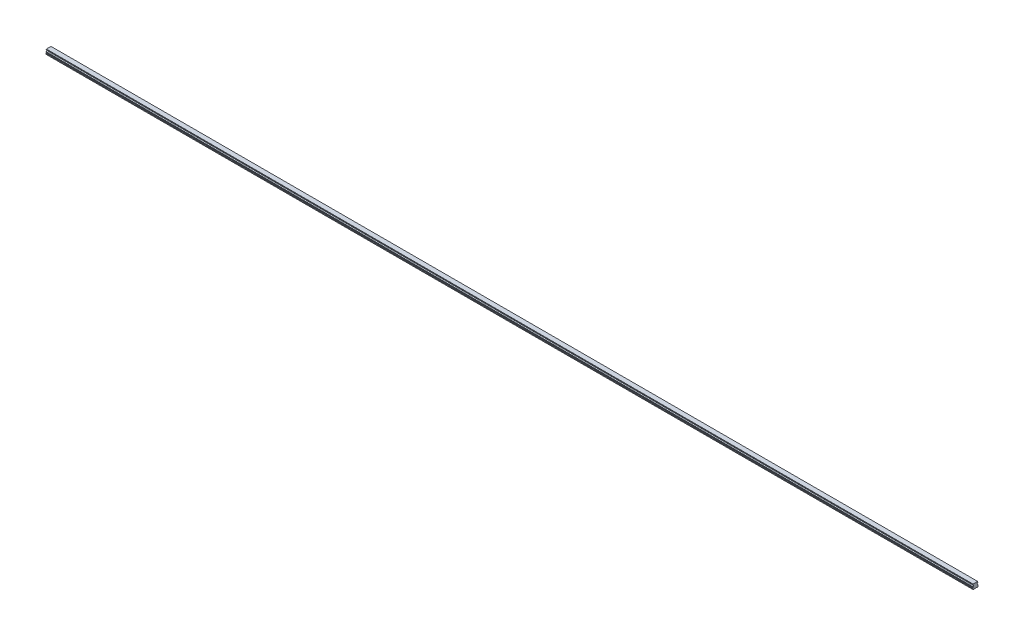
from build123d import *

# Parameters (mm, degrees)
BOSS_EXTRUDE1_DEPTH        = 2640
SKETCH3_R                  = 2.5
SKETCH3_R_2                = 2.1
CUT_EXTRUDE3_DEPTH         = 7
SKETCH3_2_R                = 2.1
CUT_EXTRUDE4_DEPTH         = 9.5
CHAMFER1_SIZE              = 0.4
LPATTERN2_COUNT            = 44
LPATTERN2_PITCH            = 60
CHAMFER1_OF_LPATTERN2_SIZE = 0.4


with BuildPart() as part:
    # Sketch1 → Boss-Extrude1 (new body)
    with BuildSketch(Plane(origin=(0, 0, 0), x_dir=(0, 0, -1), z_dir=(1, 0, 0))):
        with BuildLine():
            Line((6.59, 14), (-6.59, 14))
            Line((-6.59, 14), (-6.59, 13.15))
            Line((-6.59, 13.15), (-6.96, 12.356532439))
            Line((-6.96, 12.356532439), (-6.96, 11.435174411))
            ThreePointArc((-6.96, 11.435174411), (-5.25, 9.5), (-6.96, 7.564825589))
            Line((-6.96, 7.564825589), (-6.96, 6.643467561))
            Line((-6.96, 6.643467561), (-6.59, 5.85))
            Line((-6.59, 5.85), (-7.032116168, 4.2))
            Line((-7.032116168, 4.2), (-7.5, 3.929867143))
            Line((-7.5, 3.929867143), (-7.5, 1.4))
            Line((-7.5, 1.4), (-6.1, 0))
            Line((-6.1, 0), (-3.65, 0))
            Line((-3.65, 0), (-3.25, 0.4))
            Line((-3.25, 0.4), (3.25, 0.4))
            Line((3.25, 0.4), (3.65, 0))
            Line((3.65, 0), (6.1, 0))
            Line((6.1, 0), (7.5, 1.4))
            Line((7.5, 1.4), (7.5, 3.929867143))
            Line((7.5, 3.929867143), (7.032116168, 4.2))
            Line((7.032116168, 4.2), (6.59, 5.85))
            Line((6.59, 5.85), (6.96, 6.643467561))
            Line((6.96, 6.643467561), (6.96, 7.564825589))
            ThreePointArc((6.96, 7.564825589), (5.25, 9.5), (6.96, 11.435174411))
            Line((6.96, 11.435174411), (6.96, 12.356532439))
            Line((6.96, 12.356532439), (6.59, 13.15))
            Line((6.59, 13.15), (6.59, 14))
        make_face()
    extrude(amount=BOSS_EXTRUDE1_DEPTH)

    # Sketch3 → Cut-Extrude3 (cut)
    with BuildSketch(Plane.XZ):
        with Locations(Location((30, 0, 0), (0, 0, 270))):
            Circle(SKETCH3_R)
        with Locations(Location((30, 0, 0), (0, 0, 270))):
            Circle(SKETCH3_R_2, mode=Mode.SUBTRACT)
    cut_extrude3 = extrude(amount=-CUT_EXTRUDE3_DEPTH, mode=Mode.SUBTRACT)

    # Sketch3_2 → Cut-Extrude4 (cut)
    with BuildSketch(Plane.XZ):
        with Locations(Location((30, 0, 0), (0, 0, 270))):
            Circle(SKETCH3_2_R)
    cut_extrude4 = extrude(amount=-CUT_EXTRUDE4_DEPTH, mode=Mode.SUBTRACT)

    # Cut-Extrude5 cone 1 section (on through the dimple's axis) → Cut-Extrude5 (revolve, cut)
    with BuildSketch(Plane(origin=(30, 9.5, 0), x_dir=(0, 0, -1), z_dir=(1, 0, 0))):
        Polygon((0, 0), (2.1, 0), (0, 1.212435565), align=None)
    revolve(axis=Axis((30, 9.5, 0), (0, 1, 0)), mode=Mode.SUBTRACT)

    # Chamfer1
    chamfer1_edges = [part.edges().sort_by_distance(p)[0] for p in [
        (30, 0.4, 2.5),
    ]]
    chamfer(chamfer1_edges, length=CHAMFER1_SIZE)

    # LPattern2: Cut-Extrude3, Cut-Extrude4 ×44
    with Locations(*[(i * LPATTERN2_PITCH, 0, 0) for i in range(1, LPATTERN2_COUNT)]):
        add(cut_extrude3, mode=Mode.SUBTRACT)
        add(cut_extrude4, mode=Mode.SUBTRACT)

    # Chamfer1 of LPattern2
    chamfer1_of_lpattern2_edges = [part.edges().sort_by_distance(p)[0] for p in [
        (90, 0.4, 2.5),
        (150, 0.4, 2.5),
        (210, 0.4, 2.5),
        (270, 0.4, 2.5),
        (330, 0.4, 2.5),
        (390, 0.4, 2.5),
        (450, 0.4, 2.5),
        (510, 0.4, 2.5),
        (570, 0.4, 2.5),
        (630, 0.4, 2.5),
        (690, 0.4, 2.5),
        (750, 0.4, 2.5),
        (810, 0.4, 2.5),
        (870, 0.4, 2.5),
        (930, 0.4, 2.5),
        (990, 0.4, 2.5),
        (1050, 0.4, 2.5),
        (1110, 0.4, 2.5),
        (1170, 0.4, 2.5),
        (1230, 0.4, 2.5),
        (1290, 0.4, 2.5),
        (1350, 0.4, 2.5),
        (1410, 0.4, 2.5),
        (1470, 0.4, 2.5),
        (1530, 0.4, 2.5),
        (1590, 0.4, 2.5),
        (1650, 0.4, 2.5),
        (1710, 0.4, 2.5),
        (1770, 0.4, 2.5),
        (1830, 0.4, 2.5),
        (1890, 0.4, 2.5),
        (1950, 0.4, 2.5),
        (2010, 0.4, 2.5),
        (2070, 0.4, 2.5),
        (2130, 0.4, 2.5),
        (2190, 0.4, 2.5),
        (2250, 0.4, 2.5),
        (2310, 0.4, 2.5),
        (2370, 0.4, 2.5),
        (2430, 0.4, 2.5),
        (2490, 0.4, 2.5),
        (2550, 0.4, 2.5),
        (2610, 0.4, 2.5),
    ]]
    chamfer(chamfer1_of_lpattern2_edges, length=CHAMFER1_OF_LPATTERN2_SIZE)


solid = part.part
